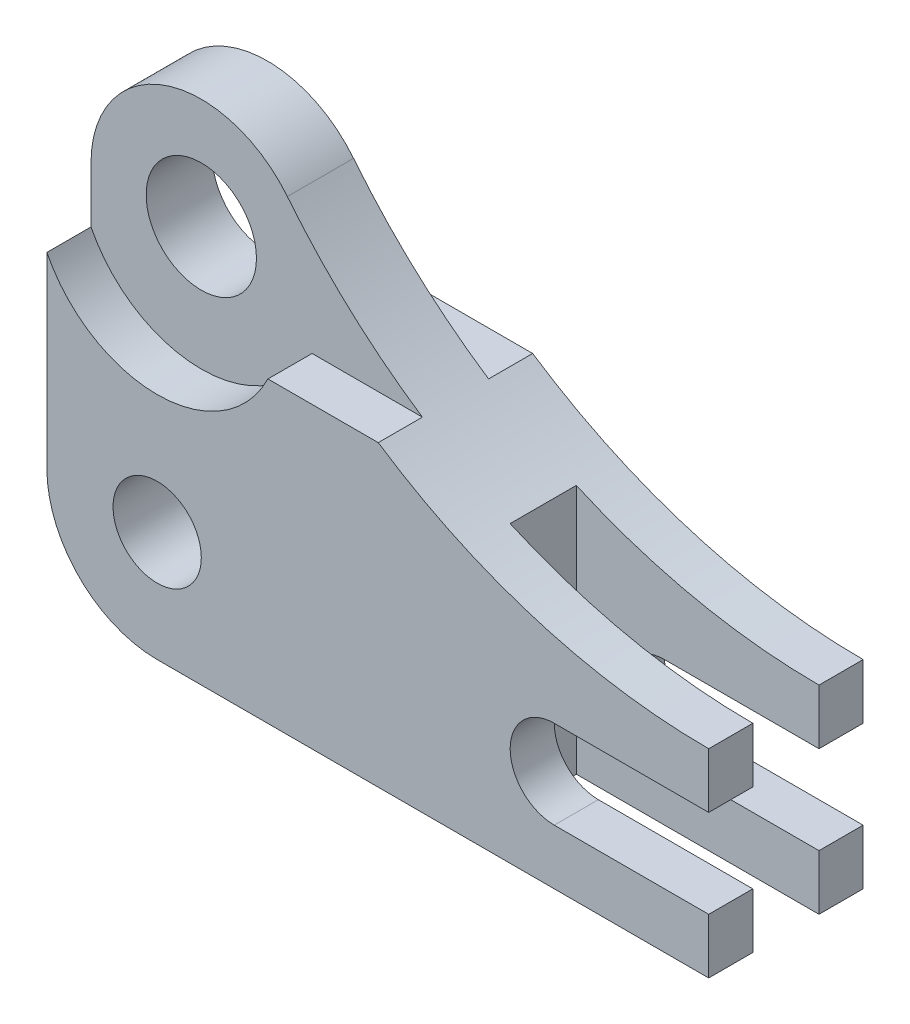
from build123d import *

# Parameters (mm, degrees)
SKETCH1_R               = 10
EXTRUDE1_DEPTH          = 17.5
CUT_EXTRUDE1_DEPTH      = 10
SKETCH3_R               = 12.5
CUT_EXTRUDE2_DEPTH      = 185.797186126
CUT_EXTRUDE4_DEPTH      = 60
CUT_EXTRUDE4_DEPTH_BACK = 30
SKETCH4_W               = 55
SKETCH4_H               = 15


with BuildPart() as part:
    # Sketch1 → Extrude1 (new, symmetric)
    with BuildSketch(Plane.XY):
        with BuildLine():
            Line((0, 25), (0, 80))
            ThreePointArc((0, 80), (16.712850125, 103.586503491), (44.505851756, 95.637191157))
            ThreePointArc((44.505851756, 95.637191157), (91.49115357, 58.314903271), (150, 45))
            Line((150, 45), (150, 32.5))
            Line((150, 32.5), (115, 32.5))
            ThreePointArc((115, 32.5), (105, 22.5), (115, 12.5))
            Line((115, 12.5), (150, 12.5))
            Line((150, 12.5), (150, 0))
            Line((150, 0), (25, 0))
            ThreePointArc((25, 0), (7.32233047, 7.32233047), (0, 25))
        make_face()
        with Locations((25, 25)):
            Circle(SKETCH1_R, mode=Mode.SUBTRACT)
    extrude(amount=EXTRUDE1_DEPTH, both=True)

    # Sketch2 → Cut-Extrude1 (cut)
    with BuildSketch(Plane.XY.offset(17.5)):
        with BuildLine():
            Line((0, 80), (0, 67.423076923))
            ThreePointArc((0, 67.423076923), (25.11957442, 52.014920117), (50.106562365, 67.637171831))
            Line((50.106562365, 67.637171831), (75.106562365, 67.637171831))
            ThreePointArc((75.106562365, 67.637171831), (58.726123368, 80.45677772), (44.505851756, 95.637191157))
            ThreePointArc((44.505851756, 95.637191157), (16.712850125, 103.586503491), (0, 80))
        make_face()
    cut_extrude1 = extrude(amount=-CUT_EXTRUDE1_DEPTH, mode=Mode.SUBTRACT)

    # Mirror1: Cut-Extrude1 across plane
    add(cut_extrude1.mirror(Plane.XY), mode=Mode.SUBTRACT)

    # Sketch3 → Cut-Extrude2 (cut, through all)
    with BuildSketch(Plane.XY.offset(7.5)):
        with Locations((25, 80)):
            Circle(SKETCH3_R)
    extrude(amount=-CUT_EXTRUDE2_DEPTH, mode=Mode.SUBTRACT)

    # Sketch4 → Cut-Extrude4 (cut, two sides: drawn at the far end of the back side and taken through both)
    with BuildSketch(Plane(origin=(0, 0, 0), x_dir=(1, 0, 0), z_dir=(0, 1, 0)).offset(-CUT_EXTRUDE4_DEPTH_BACK)):
        with Locations((122.5, 0)):
            Rectangle(SKETCH4_W, SKETCH4_H)
    extrude(amount=CUT_EXTRUDE4_DEPTH + CUT_EXTRUDE4_DEPTH_BACK, mode=Mode.SUBTRACT)


solid = part.part
